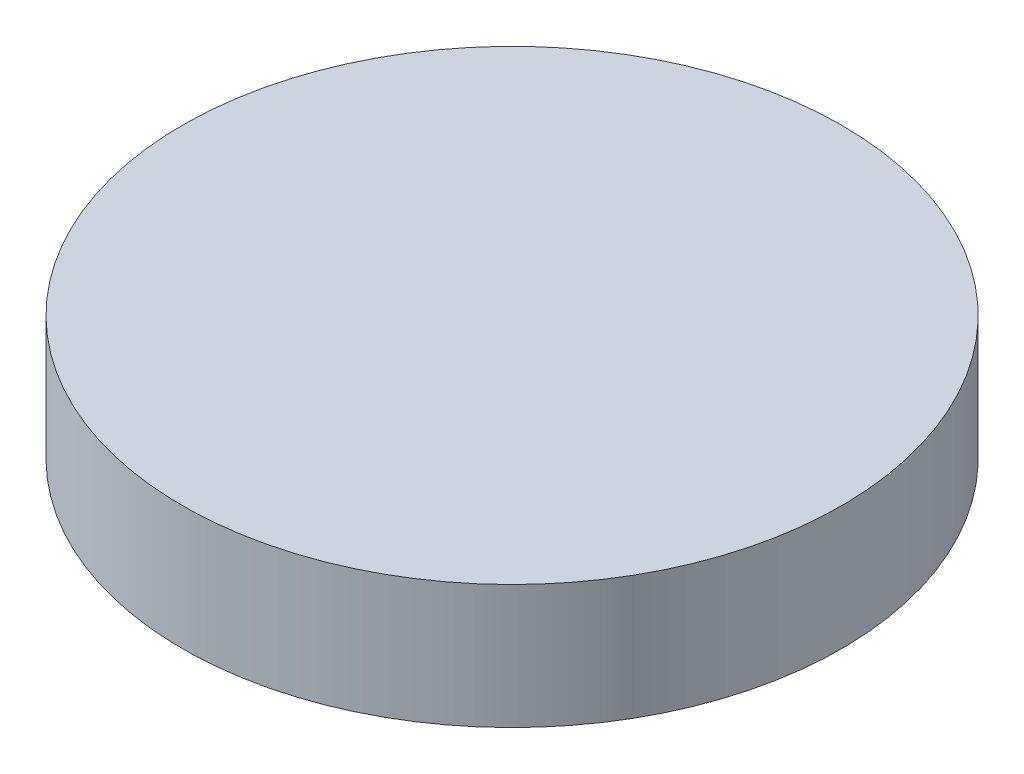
ISO-10303-21;
HEADER;
FILE_DESCRIPTION(('STEP AP214'),'2;1');
FILE_NAME('part.step','',(''),(''),'','','');
FILE_SCHEMA(('AUTOMOTIVE_DESIGN { 1 0 10303 214 1 1 1 1 }'));
ENDSEC;
DATA;
#1=APPLICATION_CONTEXT('core data for automotive mechanical design processes');
#2=APPLICATION_PROTOCOL_DEFINITION('international standard','automotive_design',2000,#1);
#3=PRODUCT_CONTEXT('',#1,'mechanical');
#4=PRODUCT('Part','Part','',(#3));
#5=PRODUCT_RELATED_PRODUCT_CATEGORY('part','',(#4));
#6=PRODUCT_DEFINITION_FORMATION('','',#4);
#7=PRODUCT_DEFINITION_CONTEXT('part definition',#1,'design');
#8=PRODUCT_DEFINITION('design','',#6,#7);
#9=PRODUCT_DEFINITION_SHAPE('','',#8);
#10=(LENGTH_UNIT() NAMED_UNIT(*) SI_UNIT(.MILLI.,.METRE.));
#11=(NAMED_UNIT(*) PLANE_ANGLE_UNIT() SI_UNIT($,.RADIAN.));
#12=(NAMED_UNIT(*) SI_UNIT($,.STERADIAN.) SOLID_ANGLE_UNIT());
#13=UNCERTAINTY_MEASURE_WITH_UNIT(LENGTH_MEASURE(1.E-05),#10,'distance_accuracy_value','');
#14=(GEOMETRIC_REPRESENTATION_CONTEXT(3) GLOBAL_UNCERTAINTY_ASSIGNED_CONTEXT((#13)) GLOBAL_UNIT_ASSIGNED_CONTEXT((#10,
#11,#12)) REPRESENTATION_CONTEXT('',''));
#15=CARTESIAN_POINT('',(0.,0.,0.));
#16=DIRECTION('',(0.,0.,1.));
#17=DIRECTION('',(1.,0.,0.));
#18=AXIS2_PLACEMENT_3D('',#15,#16,#17);
#19=CARTESIAN_POINT('',(0.,19.05,0.));
#20=DIRECTION('',(0.,-1.,0.));
#21=DIRECTION('',(0.,0.,-1.));
#22=AXIS2_PLACEMENT_3D('',#19,#20,#21);
#23=CYLINDRICAL_SURFACE('',#22,50.673);
#24=CARTESIAN_POINT('',(0.,19.05,0.));
#25=DIRECTION('',(0.,1.,0.));
#26=DIRECTION('',(0.,0.,1.));
#27=AXIS2_PLACEMENT_3D('',#24,#25,#26);
#28=CIRCLE('',#27,50.673);
#29=CARTESIAN_POINT('',(0.,19.05,-50.673));
#30=VERTEX_POINT('',#29);
#31=EDGE_CURVE('E11',#30,#30,#28,.T.);
#32=CARTESIAN_POINT('',(0.,0.,0.));
#33=DIRECTION('',(0.,1.,0.));
#34=DIRECTION('',(0.,0.,1.));
#35=AXIS2_PLACEMENT_3D('',#32,#33,#34);
#36=CIRCLE('',#35,50.673);
#37=CARTESIAN_POINT('',(0.,0.,-50.673));
#38=VERTEX_POINT('',#37);
#39=EDGE_CURVE('E42',#38,#38,#36,.T.);
#40=CARTESIAN_POINT('',(0.,19.05,-50.673));
#41=CARTESIAN_POINT('',(0.,18.8515625,-50.673));
#42=CARTESIAN_POINT('',(0.,18.653125,-50.673));
#43=CARTESIAN_POINT('',(0.,18.25625,-50.673));
#44=CARTESIAN_POINT('',(0.,18.0578125,-50.673));
#45=CARTESIAN_POINT('',(0.,17.6609375,-50.673));
#46=CARTESIAN_POINT('',(0.,17.4625,-50.673));
#47=CARTESIAN_POINT('',(0.,17.065625,-50.673));
#48=CARTESIAN_POINT('',(0.,16.8671875,-50.673));
#49=CARTESIAN_POINT('',(0.,16.4703125,-50.673));
#50=CARTESIAN_POINT('',(0.,16.271875,-50.673));
#51=CARTESIAN_POINT('',(0.,15.875,-50.673));
#52=CARTESIAN_POINT('',(0.,15.6765625,-50.673));
#53=CARTESIAN_POINT('',(0.,15.2796875,-50.673));
#54=CARTESIAN_POINT('',(0.,15.08125,-50.673));
#55=CARTESIAN_POINT('',(0.,14.684375,-50.673));
#56=CARTESIAN_POINT('',(0.,14.4859375,-50.673));
#57=CARTESIAN_POINT('',(0.,14.0890625,-50.673));
#58=CARTESIAN_POINT('',(0.,13.890625,-50.673));
#59=CARTESIAN_POINT('',(0.,13.49375,-50.673));
#60=CARTESIAN_POINT('',(0.,13.2953125,-50.673));
#61=CARTESIAN_POINT('',(0.,12.8984375,-50.673));
#62=CARTESIAN_POINT('',(0.,12.7,-50.673));
#63=CARTESIAN_POINT('',(0.,12.303125,-50.673));
#64=CARTESIAN_POINT('',(0.,12.1046875,-50.673));
#65=CARTESIAN_POINT('',(0.,11.7078125,-50.673));
#66=CARTESIAN_POINT('',(0.,11.509375,-50.673));
#67=CARTESIAN_POINT('',(0.,11.1125,-50.673));
#68=CARTESIAN_POINT('',(0.,10.9140625,-50.673));
#69=CARTESIAN_POINT('',(0.,10.5171875,-50.673));
#70=CARTESIAN_POINT('',(0.,10.31875,-50.673));
#71=CARTESIAN_POINT('',(0.,9.921875,-50.673));
#72=CARTESIAN_POINT('',(0.,9.7234375,-50.673));
#73=CARTESIAN_POINT('',(0.,9.3265625,-50.673));
#74=CARTESIAN_POINT('',(0.,9.128125,-50.673));
#75=CARTESIAN_POINT('',(0.,8.73125,-50.673));
#76=CARTESIAN_POINT('',(0.,8.5328125,-50.673));
#77=CARTESIAN_POINT('',(0.,8.1359375,-50.673));
#78=CARTESIAN_POINT('',(0.,7.9375,-50.673));
#79=CARTESIAN_POINT('',(0.,7.540625,-50.673));
#80=CARTESIAN_POINT('',(0.,7.3421875,-50.673));
#81=CARTESIAN_POINT('',(0.,6.9453125,-50.673));
#82=CARTESIAN_POINT('',(0.,6.746875,-50.673));
#83=CARTESIAN_POINT('',(0.,6.35,-50.673));
#84=CARTESIAN_POINT('',(0.,6.1515625,-50.673));
#85=CARTESIAN_POINT('',(0.,5.7546875,-50.673));
#86=CARTESIAN_POINT('',(0.,5.55625,-50.673));
#87=CARTESIAN_POINT('',(0.,5.159375,-50.673));
#88=CARTESIAN_POINT('',(0.,4.9609375,-50.673));
#89=CARTESIAN_POINT('',(0.,4.5640625,-50.673));
#90=CARTESIAN_POINT('',(0.,4.365625,-50.673));
#91=CARTESIAN_POINT('',(0.,3.96875,-50.673));
#92=CARTESIAN_POINT('',(0.,3.7703125,-50.673));
#93=CARTESIAN_POINT('',(0.,3.3734375,-50.673));
#94=CARTESIAN_POINT('',(0.,3.175,-50.673));
#95=CARTESIAN_POINT('',(0.,2.778125,-50.673));
#96=CARTESIAN_POINT('',(0.,2.5796875,-50.673));
#97=CARTESIAN_POINT('',(0.,2.1828125,-50.673));
#98=CARTESIAN_POINT('',(0.,1.984375,-50.673));
#99=CARTESIAN_POINT('',(0.,1.5875,-50.673));
#100=CARTESIAN_POINT('',(0.,1.3890625,-50.673));
#101=CARTESIAN_POINT('',(0.,0.992187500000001,-50.673));
#102=CARTESIAN_POINT('',(0.,0.793750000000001,-50.673));
#103=CARTESIAN_POINT('',(0.,0.396875,-50.673));
#104=CARTESIAN_POINT('',(0.,0.1984375,-50.673));
#105=CARTESIAN_POINT('',(0.,0.,-50.673));
#106=B_SPLINE_CURVE_WITH_KNOTS('',3,(#40,#41,#42,#43,#44,#45,#46,#47,#48,#49,#50,#51,#52,#53,
#54,#55,#56,#57,#58,#59,#60,#61,#62,#63,#64,#65,#66,#67,#68,#69,#70,#71,#72,#73,#74,#75,#76,#77,
#78,#79,#80,#81,#82,#83,#84,#85,#86,#87,#88,#89,#90,#91,#92,#93,#94,#95,#96,#97,#98,#99,#100,
#101,#102,#103,#104,#105),.UNSPECIFIED.,.F.,.F.,(4,2,2,2,2,2,2,2,2,2,2,2,2,2,2,2,2,2,2,2,2,2,2,
2,2,2,2,2,2,2,2,2,4),(0.,0.595312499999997,1.190625,1.7859375,2.38125,2.9765625,3.571875,
4.1671875,4.7625,5.3578125,5.953125,6.5484375,7.14375,7.7390625,8.334375,8.9296875,9.525,
10.1203125,10.715625,11.3109375,11.90625,12.5015625,13.096875,13.6921875,14.2875,14.8828125,
15.478125,16.0734375,16.66875,17.2640625,17.859375,18.4546875,19.05),.UNSPECIFIED.);
#107=EDGE_CURVE('BSEAM39',#30,#38,#106,.T.);
#108=ORIENTED_EDGE('',*,*,#31,.F.);
#109=ORIENTED_EDGE('',*,*,#39,.T.);
#110=ORIENTED_EDGE('',*,*,#107,.T.);
#111=ORIENTED_EDGE('',*,*,#107,.F.);
#112=EDGE_LOOP('',(#108,#110,#109,#111));
#113=FACE_BOUND('',#112,.T.);
#114=ADVANCED_FACE('F39',(#113),#23,.T.);
#115=CARTESIAN_POINT('',(0.,19.05,0.));
#116=DIRECTION('',(0.,1.,0.));
#117=DIRECTION('',(0.,0.,1.));
#118=AXIS2_PLACEMENT_3D('',#115,#116,#117);
#119=PLANE('',#118);
#120=ORIENTED_EDGE('',*,*,#31,.T.);
#121=EDGE_LOOP('',(#120));
#122=FACE_BOUND('',#121,.T.);
#123=ADVANCED_FACE('F131',(#122),#119,.T.);
#124=CARTESIAN_POINT('',(0.,0.,0.));
#125=DIRECTION('',(0.,1.,0.));
#126=DIRECTION('',(0.,0.,1.));
#127=AXIS2_PLACEMENT_3D('',#124,#125,#126);
#128=PLANE('',#127);
#129=DIRECTION('',(-1.,0.,0.));
#130=VECTOR('',#129,1.);
#131=CARTESIAN_POINT('',(-6.604,0.,5.588));
#132=LINE('',#131,#130);
#133=CARTESIAN_POINT('',(6.604,0.,5.588));
#134=VERTEX_POINT('',#133);
#135=CARTESIAN_POINT('',(-6.604,0.,5.588));
#136=VERTEX_POINT('',#135);
#137=EDGE_CURVE('E88',#134,#136,#132,.T.);
#138=ORIENTED_EDGE('',*,*,#137,.F.);
#139=DIRECTION('',(0.,0.,1.));
#140=VECTOR('',#139,1.);
#141=CARTESIAN_POINT('',(6.604,0.,5.588));
#142=LINE('',#141,#140);
#143=CARTESIAN_POINT('',(6.604,0.,-5.588));
#144=VERTEX_POINT('',#143);
#145=EDGE_CURVE('E53',#144,#134,#142,.T.);
#146=ORIENTED_EDGE('',*,*,#145,.F.);
#147=DIRECTION('',(1.,0.,0.));
#148=VECTOR('',#147,1.);
#149=CARTESIAN_POINT('',(-6.604,0.,-5.588));
#150=LINE('',#149,#148);
#151=CARTESIAN_POINT('',(-6.604,0.,-5.588));
#152=VERTEX_POINT('',#151);
#153=EDGE_CURVE('E104',#152,#144,#150,.T.);
#154=ORIENTED_EDGE('',*,*,#153,.F.);
#155=DIRECTION('',(0.,0.,-1.));
#156=VECTOR('',#155,1.);
#157=CARTESIAN_POINT('',(-6.604,0.,5.588));
#158=LINE('',#157,#156);
#159=EDGE_CURVE('E110',#136,#152,#158,.T.);
#160=ORIENTED_EDGE('',*,*,#159,.F.);
#161=EDGE_LOOP('',(#138,#146,#154,#160));
#162=FACE_BOUND('',#161,.T.);
#163=ORIENTED_EDGE('',*,*,#39,.F.);
#164=EDGE_LOOP('',(#163));
#165=FACE_BOUND('',#164,.T.);
#166=ADVANCED_FACE('F116',(#162,#165),#128,.F.);
#167=CARTESIAN_POINT('',(6.604,12.7,5.588));
#168=DIRECTION('',(1.,0.,0.));
#169=DIRECTION('',(0.,0.,-1.));
#170=AXIS2_PLACEMENT_3D('',#167,#168,#169);
#171=PLANE('',#170);
#172=ORIENTED_EDGE('',*,*,#145,.T.);
#173=DIRECTION('',(0.,-1.,0.));
#174=VECTOR('',#173,1.);
#175=CARTESIAN_POINT('',(6.604,12.7,5.588));
#176=LINE('',#175,#174);
#177=CARTESIAN_POINT('',(6.604,12.7,5.588));
#178=VERTEX_POINT('',#177);
#179=EDGE_CURVE('E76',#178,#134,#176,.T.);
#180=ORIENTED_EDGE('',*,*,#179,.F.);
#181=DIRECTION('',(0.,0.,1.));
#182=VECTOR('',#181,1.);
#183=CARTESIAN_POINT('',(6.604,12.7,5.588));
#184=LINE('',#183,#182);
#185=CARTESIAN_POINT('',(6.604,12.7,-5.588));
#186=VERTEX_POINT('',#185);
#187=EDGE_CURVE('E102',#186,#178,#184,.T.);
#188=ORIENTED_EDGE('',*,*,#187,.F.);
#189=DIRECTION('',(0.,-1.,0.));
#190=VECTOR('',#189,1.);
#191=CARTESIAN_POINT('',(6.604,12.7,-5.588));
#192=LINE('',#191,#190);
#193=EDGE_CURVE('E61',#186,#144,#192,.T.);
#194=ORIENTED_EDGE('',*,*,#193,.T.);
#195=EDGE_LOOP('',(#172,#180,#188,#194));
#196=FACE_BOUND('',#195,.T.);
#197=ADVANCED_FACE('F121',(#196),#171,.F.);
#198=CARTESIAN_POINT('',(-6.604,12.7,-5.588));
#199=DIRECTION('',(0.,0.,-1.));
#200=DIRECTION('',(-1.,0.,0.));
#201=AXIS2_PLACEMENT_3D('',#198,#199,#200);
#202=PLANE('',#201);
#203=ORIENTED_EDGE('',*,*,#153,.T.);
#204=ORIENTED_EDGE('',*,*,#193,.F.);
#205=DIRECTION('',(1.,0.,0.));
#206=VECTOR('',#205,1.);
#207=CARTESIAN_POINT('',(-6.604,12.7,-5.588));
#208=LINE('',#207,#206);
#209=CARTESIAN_POINT('',(-6.604,12.7,-5.588));
#210=VERTEX_POINT('',#209);
#211=EDGE_CURVE('E99',#210,#186,#208,.T.);
#212=ORIENTED_EDGE('',*,*,#211,.F.);
#213=DIRECTION('',(0.,-1.,0.));
#214=VECTOR('',#213,1.);
#215=CARTESIAN_POINT('',(-6.604,12.7,-5.588));
#216=LINE('',#215,#214);
#217=EDGE_CURVE('E92',#210,#152,#216,.T.);
#218=ORIENTED_EDGE('',*,*,#217,.T.);
#219=EDGE_LOOP('',(#203,#204,#212,#218));
#220=FACE_BOUND('',#219,.T.);
#221=ADVANCED_FACE('F119',(#220),#202,.F.);
#222=CARTESIAN_POINT('',(-6.604,12.7,5.588));
#223=DIRECTION('',(-1.,0.,0.));
#224=DIRECTION('',(0.,0.,1.));
#225=AXIS2_PLACEMENT_3D('',#222,#223,#224);
#226=PLANE('',#225);
#227=ORIENTED_EDGE('',*,*,#159,.T.);
#228=ORIENTED_EDGE('',*,*,#217,.F.);
#229=DIRECTION('',(0.,0.,-1.));
#230=VECTOR('',#229,1.);
#231=CARTESIAN_POINT('',(-6.604,12.7,5.588));
#232=LINE('',#231,#230);
#233=CARTESIAN_POINT('',(-6.604,12.7,5.588));
#234=VERTEX_POINT('',#233);
#235=EDGE_CURVE('E95',#234,#210,#232,.T.);
#236=ORIENTED_EDGE('',*,*,#235,.F.);
#237=DIRECTION('',(0.,-1.,0.));
#238=VECTOR('',#237,1.);
#239=CARTESIAN_POINT('',(-6.604,12.7,5.588));
#240=LINE('',#239,#238);
#241=EDGE_CURVE('E81',#234,#136,#240,.T.);
#242=ORIENTED_EDGE('',*,*,#241,.T.);
#243=EDGE_LOOP('',(#227,#228,#236,#242));
#244=FACE_BOUND('',#243,.T.);
#245=ADVANCED_FACE('F96',(#244),#226,.F.);
#246=CARTESIAN_POINT('',(-6.604,12.7,5.588));
#247=DIRECTION('',(0.,0.,1.));
#248=DIRECTION('',(1.,0.,0.));
#249=AXIS2_PLACEMENT_3D('',#246,#247,#248);
#250=PLANE('',#249);
#251=ORIENTED_EDGE('',*,*,#137,.T.);
#252=ORIENTED_EDGE('',*,*,#241,.F.);
#253=DIRECTION('',(-1.,0.,0.));
#254=VECTOR('',#253,1.);
#255=CARTESIAN_POINT('',(-6.604,12.7,5.588));
#256=LINE('',#255,#254);
#257=EDGE_CURVE('E85',#178,#234,#256,.T.);
#258=ORIENTED_EDGE('',*,*,#257,.F.);
#259=ORIENTED_EDGE('',*,*,#179,.T.);
#260=EDGE_LOOP('',(#251,#252,#258,#259));
#261=FACE_BOUND('',#260,.T.);
#262=ADVANCED_FACE('F83',(#261),#250,.F.);
#263=CARTESIAN_POINT('',(0.,12.7,0.));
#264=DIRECTION('',(0.,-1.,0.));
#265=DIRECTION('',(0.,0.,-1.));
#266=AXIS2_PLACEMENT_3D('',#263,#264,#265);
#267=PLANE('',#266);
#268=ORIENTED_EDGE('',*,*,#187,.T.);
#269=ORIENTED_EDGE('',*,*,#257,.T.);
#270=ORIENTED_EDGE('',*,*,#235,.T.);
#271=ORIENTED_EDGE('',*,*,#211,.T.);
#272=EDGE_LOOP('',(#268,#269,#270,#271));
#273=FACE_BOUND('',#272,.T.);
#274=ADVANCED_FACE('F101',(#273),#267,.T.);
#275=CLOSED_SHELL('',(#114,#123,#166,#197,#221,#245,#262,#274));
#276=MANIFOLD_SOLID_BREP('B2',#275);
#277=ADVANCED_BREP_SHAPE_REPRESENTATION('',(#18,#276),#14);
#278=SHAPE_DEFINITION_REPRESENTATION(#9,#277);
ENDSEC;
END-ISO-10303-21;
